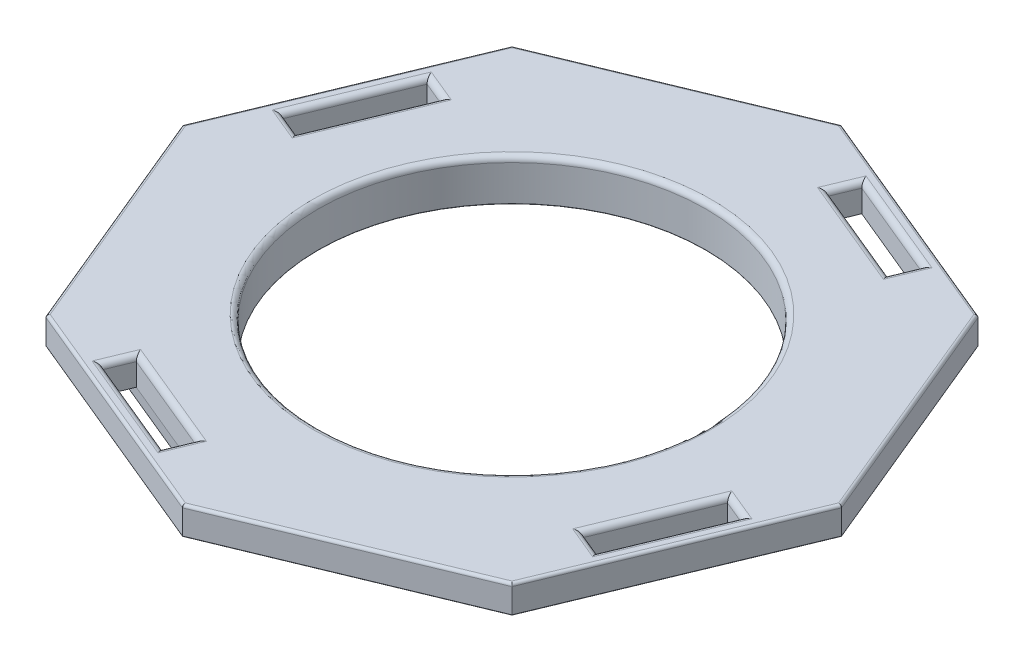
from build123d import *

# Parameters (mm, degrees)
BOSS_EXTRUDE1_DEPTH = 5
BOSS_EXTRUDE2_DEPTH = 2.5
BOSS_EXTRUDE2_TAPER = 6.5
SKETCH4_R           = 35
CUT_EXTRUDE1_DEPTH  = 26.5
CUT_EXTRUDE2_DEPTH  = 85.523759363
FILLET6_R           = 1
FILLET7_R           = 1
FILLET8_R           = 0.5
FILLET9_R           = 0.1


with BuildPart() as part:
    # Sketch1 → Boss-Extrude1 (new body)
    with BuildSketch(Plane(origin=(0, 0, 0), x_dir=(1, 0, 0), z_dir=(0, 1, 0))):
        Polygon((59.531571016, 0), (42.09517756, 42.09517756), (0, 59.531571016), (-42.09517756, 42.09517756), (-59.531571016, 0), (-42.09517756, -42.09517756), (0, -59.531571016), (42.09517756, -42.09517756), align=None)
    extrude(amount=BOSS_EXTRUDE1_DEPTH)

    # Sketch2 → Boss-Extrude2 (add)
    with BuildSketch(Plane.XZ):
        Polygon((51.7, 0), (36.557420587, 36.557420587), (0, 51.7), (-36.557420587, 36.557420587), (-51.7, 0), (-36.557420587, -36.557420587), (0, -51.7), (36.557420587, -36.557420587), align=None)
    extrude(amount=BOSS_EXTRUDE2_DEPTH, taper=BOSS_EXTRUDE2_TAPER)

    # Sketch4 → Cut-Extrude1 (cut)
    with BuildSketch(Plane(origin=(0, 5, 0), x_dir=(1, 0, 0), z_dir=(0, 1, 0))):
        with Locations(Location((0, 0, 0), (0, 0, 270))):
            Circle(SKETCH4_R)
    extrude(amount=-CUT_EXTRUDE1_DEPTH, mode=Mode.SUBTRACT)

    # Sketch7 → Cut-Extrude2 (cut, through all)
    with BuildSketch(Plane(origin=(0, 5, 0), x_dir=(1, 0, 0), z_dir=(0, 1, 0))):
        Polygon((9.053472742, 47.988275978), (27.531063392, 40.33460733), (29.329675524, 44.676841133), (10.852084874, 52.33050978), align=None)
        Polygon((-47.988275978, 9.053472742), (-52.33050978, 10.852084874), (-44.676841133, 29.329675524), (-40.33460733, 27.531063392), align=None)
        Polygon((-9.053472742, -47.988275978), (-10.852084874, -52.33050978), (-29.329675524, -44.676841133), (-27.531063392, -40.33460733), align=None)
        Polygon((47.988275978, -9.053472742), (52.33050978, -10.852084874), (44.676841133, -29.329675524), (40.33460733, -27.531063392), align=None)
    extrude(amount=-CUT_EXTRUDE2_DEPTH, mode=Mode.SUBTRACT)

    # Fillet6
    fillet6_edges = [part.edges().sort_by_distance(p)[0] for p in [
        (44.161441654, 5, 18.292268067),
        (42.505724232, 5, 28.430369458),
        (48.503675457, 5, 20.090880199),
        (50.159392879, 5, 9.952778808),
        (9.952778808, 5, -50.159392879),
        (18.292268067, 5, -44.161441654),
        (28.430369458, 5, -42.505724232),
        (20.090880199, 5, -48.503675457),
        (-44.161441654, 5, -18.292268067),
        (-42.505724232, 5, -28.430369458),
        (-48.503675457, 5, -20.090880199),
        (-50.159392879, 5, -9.952778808),
        (-18.292268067, 5, 44.161441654),
        (-28.430369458, 5, 42.505724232),
        (-20.090880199, 5, 48.503675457),
        (-9.952778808, 5, 50.159392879),
    ]]
    fillet(fillet6_edges, radius=FILLET6_R)

    # Fillet7
    fillet7_edges = [part.edges().sort_by_distance(p)[0] for p in [
        (0, 5, -35),
    ]]
    fillet(fillet7_edges, radius=FILLET7_R)

    # Fillet8
    fillet8_edges = [part.edges().sort_by_distance(p)[0] for p in [
        (21.04758878, 5, -50.813374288),
        (-21.04758878, 5, -50.813374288),
        (-50.813374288, 5, -21.04758878),
        (-50.813374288, 5, 21.04758878),
        (-21.04758878, 5, 50.813374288),
        (21.04758878, 5, 50.813374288),
        (50.813374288, 5, 21.04758878),
        (50.813374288, 5, -21.04758878),
    ]]
    fillet(fillet8_edges, radius=FILLET8_R)

    # Fillet9
    fillet9_edges = [part.edges().sort_by_distance(p)[0] for p in [
        (50.813374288, 0, -21.04758878),
        (50.813374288, 0, 21.04758878),
        (42.09517756, 2.25, 42.09517756),
        (0, 2.25, 59.531571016),
        (-42.09517756, 2.25, 42.09517756),
        (-59.531571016, 2.25, 0),
        (-42.09517756, 2.25, -42.09517756),
        (0, 2.25, -59.531571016),
        (42.09517756, 2.25, -42.09517756),
        (59.531571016, 2.25, 0),
        (-41.977696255, 4.860465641, -41.977696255),
        (0, 4.860465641, -59.365427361),
        (-59.365427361, 4.860465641, 0),
        (41.977696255, 4.860465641, -41.977696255),
        (-41.977696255, 4.860465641, 41.977696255),
        (59.365427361, 4.860465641, 0),
        (0, 4.860465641, 59.365427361),
        (41.977696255, 4.860465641, 41.977696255),
        (43.865553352, -2.5, -18.16970712),
        (43.865553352, -2.5, 18.16970712),
        (18.16970712, -2.5, 43.865553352),
        (-18.16970712, -2.5, 43.865553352),
        (-43.865553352, -2.5, 18.16970712),
        (-43.865553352, -2.5, -18.16970712),
        (-18.16970712, -2.5, -43.865553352),
        (18.16970712, -2.5, -43.865553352),
        (0, -2.5, -35),
        (21.04758878, 0, 50.813374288),
        (-21.04758878, 0, 50.813374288),
        (-50.813374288, 0, 21.04758878),
        (-50.813374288, 0, -21.04758878),
        (-21.04758878, 0, -50.813374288),
        (21.04758878, 0, -50.813374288),
    ]]
    fillet(fillet9_edges, radius=FILLET9_R)


solid = part.part
